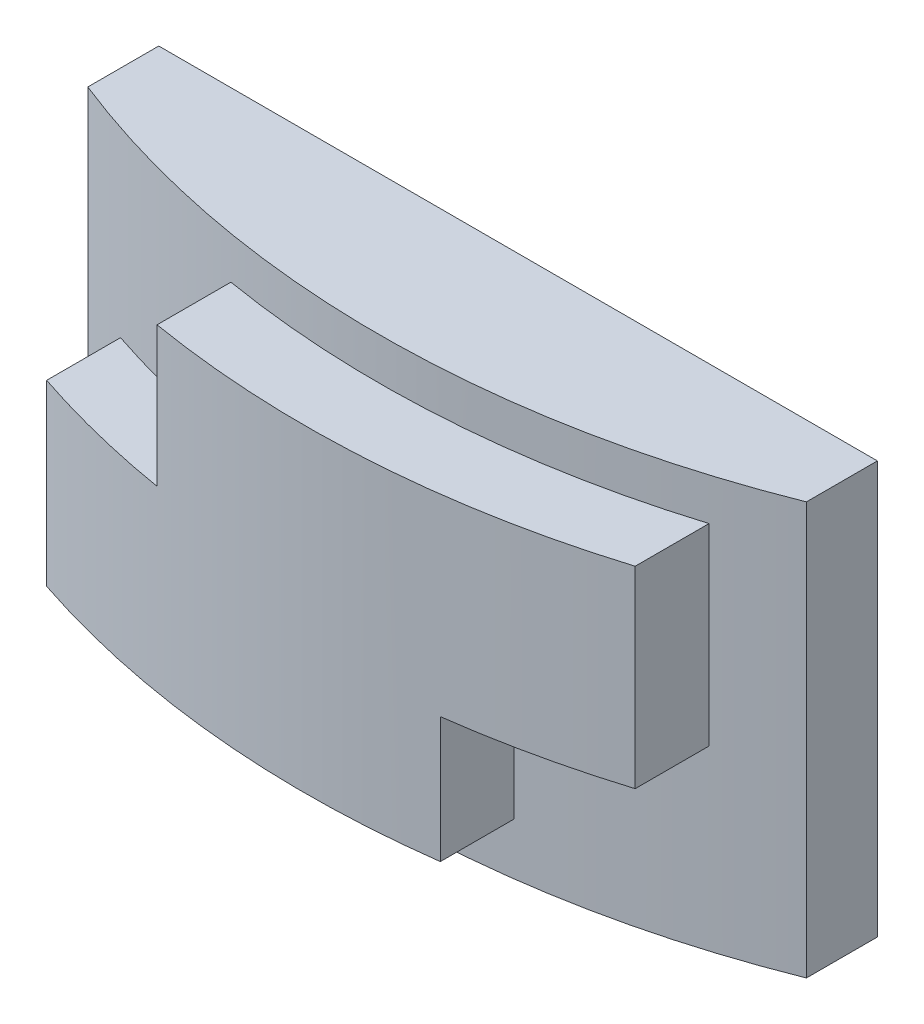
ISO-10303-21;
HEADER;
FILE_DESCRIPTION(('STEP AP214'),'2;1');
FILE_NAME('part.step','',(''),(''),'','','');
FILE_SCHEMA(('AUTOMOTIVE_DESIGN { 1 0 10303 214 1 1 1 1 }'));
ENDSEC;
DATA;
#1=APPLICATION_CONTEXT('core data for automotive mechanical design processes');
#2=APPLICATION_PROTOCOL_DEFINITION('international standard','automotive_design',2000,#1);
#3=PRODUCT_CONTEXT('',#1,'mechanical');
#4=PRODUCT('Part','Part','',(#3));
#5=PRODUCT_RELATED_PRODUCT_CATEGORY('part','',(#4));
#6=PRODUCT_DEFINITION_FORMATION('','',#4);
#7=PRODUCT_DEFINITION_CONTEXT('part definition',#1,'design');
#8=PRODUCT_DEFINITION('design','',#6,#7);
#9=PRODUCT_DEFINITION_SHAPE('','',#8);
#10=(LENGTH_UNIT() NAMED_UNIT(*) SI_UNIT(.MILLI.,.METRE.));
#11=(NAMED_UNIT(*) PLANE_ANGLE_UNIT() SI_UNIT($,.RADIAN.));
#12=(NAMED_UNIT(*) SI_UNIT($,.STERADIAN.) SOLID_ANGLE_UNIT());
#13=UNCERTAINTY_MEASURE_WITH_UNIT(LENGTH_MEASURE(1.E-05),#10,'distance_accuracy_value','');
#14=(GEOMETRIC_REPRESENTATION_CONTEXT(3) GLOBAL_UNCERTAINTY_ASSIGNED_CONTEXT((#13)) GLOBAL_UNIT_ASSIGNED_CONTEXT((#10,
#11,#12)) REPRESENTATION_CONTEXT('',''));
#15=CARTESIAN_POINT('',(0.,0.,0.));
#16=DIRECTION('',(0.,0.,1.));
#17=DIRECTION('',(1.,0.,0.));
#18=AXIS2_PLACEMENT_3D('',#15,#16,#17);
#19=CARTESIAN_POINT('',(1.12058823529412,69.4428014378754,-152.267457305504));
#20=DIRECTION('',(0.,-1.,0.));
#21=DIRECTION('',(0.,0.,-1.));
#22=AXIS2_PLACEMENT_3D('',#19,#20,#21);
#23=CYLINDRICAL_SURFACE('',#22,163.850701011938);
#24=DIRECTION('',(0.,-1.,0.));
#25=VECTOR('',#24,1.);
#26=CARTESIAN_POINT('',(-50.712715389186,69.4428014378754,3.16857731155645));
#27=LINE('',#26,#25);
#28=CARTESIAN_POINT('',(-50.712715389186,38.8031000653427,3.16857731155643));
#29=VERTEX_POINT('',#28);
#30=CARTESIAN_POINT('',(-50.712715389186,8.7600222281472,3.16857731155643));
#31=VERTEX_POINT('',#30);
#32=EDGE_CURVE('E136',#29,#31,#27,.T.);
#33=ORIENTED_EDGE('',*,*,#32,.F.);
#34=CARTESIAN_POINT('',(1.12058823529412,38.8031000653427,-152.267457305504));
#35=DIRECTION('',(0.,-1.,0.));
#36=DIRECTION('',(0.,0.,-1.));
#37=AXIS2_PLACEMENT_3D('',#34,#35,#36);
#38=CIRCLE('',#37,163.850701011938);
#39=CARTESIAN_POINT('',(-25.9572192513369,38.8031000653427,9.33032907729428));
#40=VERTEX_POINT('',#39);
#41=EDGE_CURVE('E47',#40,#29,#38,.T.);
#42=ORIENTED_EDGE('',*,*,#41,.F.);
#43=DIRECTION('',(0.,-1.,0.));
#44=VECTOR('',#43,1.);
#45=CARTESIAN_POINT('',(-25.9572192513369,69.4428014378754,9.33032907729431));
#46=LINE('',#45,#44);
#47=CARTESIAN_POINT('',(-25.9572192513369,62.356873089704,9.33032907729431));
#48=VERTEX_POINT('',#47);
#49=EDGE_CURVE('E52',#48,#40,#46,.T.);
#50=ORIENTED_EDGE('',*,*,#49,.F.);
#51=CARTESIAN_POINT('',(1.12058823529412,62.356873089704,-152.267457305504));
#52=DIRECTION('',(0.,-1.,0.));
#53=DIRECTION('',(1.,0.,0.));
#54=AXIS2_PLACEMENT_3D('',#51,#52,#53);
#55=CIRCLE('',#54,163.850701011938);
#56=CARTESIAN_POINT('',(49.5109922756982,62.3568730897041,4.27461697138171));
#57=VERTEX_POINT('',#56);
#58=EDGE_CURVE('E162',#57,#48,#55,.T.);
#59=ORIENTED_EDGE('',*,*,#58,.F.);
#60=DIRECTION('',(0.,-1.,0.));
#61=VECTOR('',#60,1.);
#62=CARTESIAN_POINT('',(49.5109922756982,69.4428014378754,4.27461697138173));
#63=LINE('',#62,#61);
#64=CARTESIAN_POINT('',(49.5109922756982,29.9103490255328,4.27461697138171));
#65=VERTEX_POINT('',#64);
#66=EDGE_CURVE('E161',#57,#65,#63,.T.);
#67=ORIENTED_EDGE('',*,*,#66,.T.);
#68=CARTESIAN_POINT('',(1.12058823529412,29.9103490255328,-152.267457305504));
#69=DIRECTION('',(0.,1.,0.));
#70=DIRECTION('',(0.,0.,1.));
#71=AXIS2_PLACEMENT_3D('',#68,#69,#70);
#72=CIRCLE('',#71,163.850701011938);
#73=CARTESIAN_POINT('',(22.592394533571,29.9103490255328,10.1702653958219));
#74=VERTEX_POINT('',#73);
#75=EDGE_CURVE('E153',#74,#65,#72,.T.);
#76=ORIENTED_EDGE('',*,*,#75,.F.);
#77=DIRECTION('',(0.,-1.,0.));
#78=VECTOR('',#77,1.);
#79=CARTESIAN_POINT('',(22.592394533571,69.4428014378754,10.1702653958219));
#80=LINE('',#79,#78);
#81=CARTESIAN_POINT('',(22.592394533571,8.76002222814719,10.1702653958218));
#82=VERTEX_POINT('',#81);
#83=EDGE_CURVE('E148',#74,#82,#80,.T.);
#84=ORIENTED_EDGE('',*,*,#83,.T.);
#85=CARTESIAN_POINT('',(1.12058823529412,8.76002222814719,-152.267457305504));
#86=DIRECTION('',(0.,1.,0.));
#87=DIRECTION('',(-1.,0.,0.));
#88=AXIS2_PLACEMENT_3D('',#85,#86,#87);
#89=CIRCLE('',#88,163.850701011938);
#90=EDGE_CURVE('E144',#31,#82,#89,.T.);
#91=ORIENTED_EDGE('',*,*,#90,.F.);
#92=EDGE_LOOP('',(#33,#42,#50,#59,#67,#76,#84,#91));
#93=FACE_BOUND('',#92,.T.);
#94=CARTESIAN_POINT('',(1.12058823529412,0.,-152.267457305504));
#95=DIRECTION('',(0.,1.,0.));
#96=DIRECTION('',(0.,0.,1.));
#97=AXIS2_PLACEMENT_3D('',#94,#95,#96);
#98=CIRCLE('',#97,163.850701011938);
#99=CARTESIAN_POINT('',(-59.3911764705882,0.,0.));
#100=VERTEX_POINT('',#99);
#101=CARTESIAN_POINT('',(61.6323529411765,0.,0.));
#102=VERTEX_POINT('',#101);
#103=EDGE_CURVE('E146',#100,#102,#98,.T.);
#104=ORIENTED_EDGE('',*,*,#103,.T.);
#105=DIRECTION('',(0.,-1.,0.));
#106=VECTOR('',#105,1.);
#107=CARTESIAN_POINT('',(61.6323529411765,69.4428014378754,0.));
#108=LINE('',#107,#106);
#109=CARTESIAN_POINT('',(61.6323529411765,69.4428014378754,0.));
#110=VERTEX_POINT('',#109);
#111=EDGE_CURVE('E11',#110,#102,#108,.T.);
#112=ORIENTED_EDGE('',*,*,#111,.F.);
#113=CARTESIAN_POINT('',(1.12058823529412,69.4428014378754,-152.267457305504));
#114=DIRECTION('',(0.,1.,0.));
#115=DIRECTION('',(0.,0.,1.));
#116=AXIS2_PLACEMENT_3D('',#113,#114,#115);
#117=CIRCLE('',#116,163.850701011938);
#118=CARTESIAN_POINT('',(-59.3911764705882,69.4428014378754,0.));
#119=VERTEX_POINT('',#118);
#120=EDGE_CURVE('E199',#119,#110,#117,.T.);
#121=ORIENTED_EDGE('',*,*,#120,.F.);
#122=DIRECTION('',(0.,-1.,0.));
#123=VECTOR('',#122,1.);
#124=CARTESIAN_POINT('',(-59.3911764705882,69.4428014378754,0.));
#125=LINE('',#124,#123);
#126=EDGE_CURVE('E208',#119,#100,#125,.T.);
#127=ORIENTED_EDGE('',*,*,#126,.T.);
#128=EDGE_LOOP('',(#104,#112,#121,#127));
#129=FACE_BOUND('',#128,.T.);
#130=ADVANCED_FACE('F33',(#93,#129),#23,.T.);
#131=CARTESIAN_POINT('',(61.6323529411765,69.4428014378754,-11.9529411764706));
#132=DIRECTION('',(-1.,0.,0.));
#133=DIRECTION('',(0.,0.,1.));
#134=AXIS2_PLACEMENT_3D('',#131,#132,#133);
#135=PLANE('',#134);
#136=DIRECTION('',(0.,0.,-1.));
#137=VECTOR('',#136,1.);
#138=CARTESIAN_POINT('',(61.6323529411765,0.,-11.9529411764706));
#139=LINE('',#138,#137);
#140=CARTESIAN_POINT('',(61.6323529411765,0.,-11.9529411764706));
#141=VERTEX_POINT('',#140);
#142=EDGE_CURVE('E193',#102,#141,#139,.T.);
#143=ORIENTED_EDGE('',*,*,#142,.T.);
#144=DIRECTION('',(0.,-1.,0.));
#145=VECTOR('',#144,1.);
#146=CARTESIAN_POINT('',(61.6323529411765,69.4428014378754,-11.9529411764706));
#147=LINE('',#146,#145);
#148=CARTESIAN_POINT('',(61.6323529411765,69.4428014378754,-11.9529411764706));
#149=VERTEX_POINT('',#148);
#150=EDGE_CURVE('E40',#149,#141,#147,.T.);
#151=ORIENTED_EDGE('',*,*,#150,.F.);
#152=DIRECTION('',(0.,0.,-1.));
#153=VECTOR('',#152,1.);
#154=CARTESIAN_POINT('',(61.6323529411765,69.4428014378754,-11.9529411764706));
#155=LINE('',#154,#153);
#156=EDGE_CURVE('E202',#110,#149,#155,.T.);
#157=ORIENTED_EDGE('',*,*,#156,.F.);
#158=ORIENTED_EDGE('',*,*,#111,.T.);
#159=EDGE_LOOP('',(#143,#151,#157,#158));
#160=FACE_BOUND('',#159,.T.);
#161=ADVANCED_FACE('F234',(#160),#135,.F.);
#162=CARTESIAN_POINT('',(-59.3911764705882,69.4428014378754,-11.9529411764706));
#163=DIRECTION('',(0.,0.,1.));
#164=DIRECTION('',(1.,0.,0.));
#165=AXIS2_PLACEMENT_3D('',#162,#163,#164);
#166=PLANE('',#165);
#167=DIRECTION('',(-1.,0.,0.));
#168=VECTOR('',#167,1.);
#169=CARTESIAN_POINT('',(-59.3911764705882,0.,-11.9529411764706));
#170=LINE('',#169,#168);
#171=CARTESIAN_POINT('',(-59.3911764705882,0.,-11.9529411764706));
#172=VERTEX_POINT('',#171);
#173=EDGE_CURVE('E195',#141,#172,#170,.T.);
#174=ORIENTED_EDGE('',*,*,#173,.T.);
#175=DIRECTION('',(0.,-1.,0.));
#176=VECTOR('',#175,1.);
#177=CARTESIAN_POINT('',(-59.3911764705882,69.4428014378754,-11.9529411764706));
#178=LINE('',#177,#176);
#179=CARTESIAN_POINT('',(-59.3911764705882,69.4428014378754,-11.9529411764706));
#180=VERTEX_POINT('',#179);
#181=EDGE_CURVE('E211',#180,#172,#178,.T.);
#182=ORIENTED_EDGE('',*,*,#181,.F.);
#183=DIRECTION('',(-1.,0.,0.));
#184=VECTOR('',#183,1.);
#185=CARTESIAN_POINT('',(-59.3911764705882,69.4428014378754,-11.9529411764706));
#186=LINE('',#185,#184);
#187=EDGE_CURVE('E204',#149,#180,#186,.T.);
#188=ORIENTED_EDGE('',*,*,#187,.F.);
#189=ORIENTED_EDGE('',*,*,#150,.T.);
#190=EDGE_LOOP('',(#174,#182,#188,#189));
#191=FACE_BOUND('',#190,.T.);
#192=ADVANCED_FACE('F218',(#191),#166,.F.);
#193=CARTESIAN_POINT('',(-59.3911764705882,69.4428014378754,0.));
#194=DIRECTION('',(1.,0.,0.));
#195=DIRECTION('',(0.,0.,-1.));
#196=AXIS2_PLACEMENT_3D('',#193,#194,#195);
#197=PLANE('',#196);
#198=DIRECTION('',(0.,0.,1.));
#199=VECTOR('',#198,1.);
#200=CARTESIAN_POINT('',(-59.3911764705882,0.,0.));
#201=LINE('',#200,#199);
#202=EDGE_CURVE('E197',#172,#100,#201,.T.);
#203=ORIENTED_EDGE('',*,*,#202,.T.);
#204=ORIENTED_EDGE('',*,*,#126,.F.);
#205=DIRECTION('',(0.,0.,1.));
#206=VECTOR('',#205,1.);
#207=CARTESIAN_POINT('',(-59.3911764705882,69.4428014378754,0.));
#208=LINE('',#207,#206);
#209=EDGE_CURVE('E206',#180,#119,#208,.T.);
#210=ORIENTED_EDGE('',*,*,#209,.F.);
#211=ORIENTED_EDGE('',*,*,#181,.T.);
#212=EDGE_LOOP('',(#203,#204,#210,#211));
#213=FACE_BOUND('',#212,.T.);
#214=ADVANCED_FACE('F227',(#213),#197,.F.);
#215=CARTESIAN_POINT('',(1.12058823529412,69.4428014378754,-152.267457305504));
#216=DIRECTION('',(0.,1.,0.));
#217=DIRECTION('',(0.,0.,1.));
#218=AXIS2_PLACEMENT_3D('',#215,#216,#217);
#219=PLANE('',#218);
#220=ORIENTED_EDGE('',*,*,#120,.T.);
#221=ORIENTED_EDGE('',*,*,#156,.T.);
#222=ORIENTED_EDGE('',*,*,#187,.T.);
#223=ORIENTED_EDGE('',*,*,#209,.T.);
#224=EDGE_LOOP('',(#220,#221,#222,#223));
#225=FACE_BOUND('',#224,.T.);
#226=ADVANCED_FACE('F233',(#225),#219,.T.);
#227=CARTESIAN_POINT('',(1.12058823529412,0.,-152.267457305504));
#228=DIRECTION('',(0.,1.,0.));
#229=DIRECTION('',(0.,0.,1.));
#230=AXIS2_PLACEMENT_3D('',#227,#228,#229);
#231=PLANE('',#230);
#232=ORIENTED_EDGE('',*,*,#103,.F.);
#233=ORIENTED_EDGE('',*,*,#202,.F.);
#234=ORIENTED_EDGE('',*,*,#173,.F.);
#235=ORIENTED_EDGE('',*,*,#142,.F.);
#236=EDGE_LOOP('',(#232,#233,#234,#235));
#237=FACE_BOUND('',#236,.T.);
#238=ADVANCED_FACE('F224',(#237),#231,.F.);
#239=CARTESIAN_POINT('',(1.12058823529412,69.4428014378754,-139.824655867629));
#240=DIRECTION('',(0.,-1.,0.));
#241=DIRECTION('',(0.,0.,-1.));
#242=AXIS2_PLACEMENT_3D('',#239,#240,#241);
#243=CYLINDRICAL_SURFACE('',#242,163.850701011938);
#244=DIRECTION('',(0.,-1.,0.));
#245=VECTOR('',#244,1.);
#246=CARTESIAN_POINT('',(-50.712715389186,69.4428014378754,15.6113787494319));
#247=LINE('',#246,#245);
#248=CARTESIAN_POINT('',(-50.7127153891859,38.8031000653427,15.6113787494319));
#249=VERTEX_POINT('',#248);
#250=CARTESIAN_POINT('',(-50.712715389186,8.76002222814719,15.6113787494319));
#251=VERTEX_POINT('',#250);
#252=EDGE_CURVE('E119',#249,#251,#247,.T.);
#253=ORIENTED_EDGE('',*,*,#252,.T.);
#254=CARTESIAN_POINT('',(1.12058823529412,8.76002222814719,-139.824655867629));
#255=DIRECTION('',(0.,1.,0.));
#256=DIRECTION('',(-1.,0.,0.));
#257=AXIS2_PLACEMENT_3D('',#254,#255,#256);
#258=CIRCLE('',#257,163.850701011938);
#259=CARTESIAN_POINT('',(22.592394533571,8.76002222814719,22.6130668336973));
#260=VERTEX_POINT('',#259);
#261=EDGE_CURVE('E123',#251,#260,#258,.T.);
#262=ORIENTED_EDGE('',*,*,#261,.T.);
#263=DIRECTION('',(0.,-1.,0.));
#264=VECTOR('',#263,1.);
#265=CARTESIAN_POINT('',(22.592394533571,69.4428014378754,22.6130668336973));
#266=LINE('',#265,#264);
#267=CARTESIAN_POINT('',(22.592394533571,29.9103490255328,22.6130668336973));
#268=VERTEX_POINT('',#267);
#269=EDGE_CURVE('E151',#268,#260,#266,.T.);
#270=ORIENTED_EDGE('',*,*,#269,.F.);
#271=CARTESIAN_POINT('',(1.12058823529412,29.9103490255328,-139.824655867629));
#272=DIRECTION('',(0.,1.,0.));
#273=DIRECTION('',(0.,0.,1.));
#274=AXIS2_PLACEMENT_3D('',#271,#272,#273);
#275=CIRCLE('',#274,163.850701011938);
#276=CARTESIAN_POINT('',(49.5109922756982,29.9103490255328,16.7174184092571));
#277=VERTEX_POINT('',#276);
#278=EDGE_CURVE('E154',#268,#277,#275,.T.);
#279=ORIENTED_EDGE('',*,*,#278,.T.);
#280=DIRECTION('',(0.,-1.,0.));
#281=VECTOR('',#280,1.);
#282=CARTESIAN_POINT('',(49.5109922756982,69.4428014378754,16.7174184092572));
#283=LINE('',#282,#281);
#284=CARTESIAN_POINT('',(49.5109922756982,62.3568730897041,16.7174184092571));
#285=VERTEX_POINT('',#284);
#286=EDGE_CURVE('E158',#285,#277,#283,.T.);
#287=ORIENTED_EDGE('',*,*,#286,.F.);
#288=CARTESIAN_POINT('',(1.12058823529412,62.356873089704,-139.824655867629));
#289=DIRECTION('',(0.,-1.,0.));
#290=DIRECTION('',(1.,0.,0.));
#291=AXIS2_PLACEMENT_3D('',#288,#289,#290);
#292=CIRCLE('',#291,163.850701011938);
#293=CARTESIAN_POINT('',(-25.9572192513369,62.356873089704,21.7731305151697));
#294=VERTEX_POINT('',#293);
#295=EDGE_CURVE('E163',#285,#294,#292,.T.);
#296=ORIENTED_EDGE('',*,*,#295,.T.);
#297=DIRECTION('',(0.,-1.,0.));
#298=VECTOR('',#297,1.);
#299=CARTESIAN_POINT('',(-25.9572192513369,69.4428014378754,21.7731305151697));
#300=LINE('',#299,#298);
#301=CARTESIAN_POINT('',(-25.9572192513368,38.8031000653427,21.7731305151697));
#302=VERTEX_POINT('',#301);
#303=EDGE_CURVE('E166',#294,#302,#300,.T.);
#304=ORIENTED_EDGE('',*,*,#303,.T.);
#305=CARTESIAN_POINT('',(1.12058823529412,38.8031000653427,-139.824655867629));
#306=DIRECTION('',(0.,-1.,0.));
#307=DIRECTION('',(0.,0.,-1.));
#308=AXIS2_PLACEMENT_3D('',#305,#306,#307);
#309=CIRCLE('',#308,163.850701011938);
#310=EDGE_CURVE('E126',#302,#249,#309,.T.);
#311=ORIENTED_EDGE('',*,*,#310,.T.);
#312=EDGE_LOOP('',(#253,#262,#270,#279,#287,#296,#304,#311));
#313=FACE_BOUND('',#312,.T.);
#314=ADVANCED_FACE('F121',(#313),#243,.T.);
#315=CARTESIAN_POINT('',(-50.712715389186,69.4428014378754,3.16857731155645));
#316=DIRECTION('',(-1.,0.,0.));
#317=DIRECTION('',(0.,0.,1.));
#318=AXIS2_PLACEMENT_3D('',#315,#316,#317);
#319=PLANE('',#318);
#320=ORIENTED_EDGE('',*,*,#252,.F.);
#321=DIRECTION('',(0.,0.,1.));
#322=VECTOR('',#321,1.);
#323=CARTESIAN_POINT('',(-50.7127153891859,38.8031000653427,3.16857731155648));
#324=LINE('',#323,#322);
#325=EDGE_CURVE('E130',#29,#249,#324,.T.);
#326=ORIENTED_EDGE('',*,*,#325,.F.);
#327=ORIENTED_EDGE('',*,*,#32,.T.);
#328=DIRECTION('',(0.,0.,1.));
#329=VECTOR('',#328,1.);
#330=CARTESIAN_POINT('',(-50.712715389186,8.7600222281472,3.16857731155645));
#331=LINE('',#330,#329);
#332=EDGE_CURVE('E134',#31,#251,#331,.T.);
#333=ORIENTED_EDGE('',*,*,#332,.T.);
#334=EDGE_LOOP('',(#320,#326,#327,#333));
#335=FACE_BOUND('',#334,.T.);
#336=ADVANCED_FACE('F135',(#335),#319,.T.);
#337=CARTESIAN_POINT('',(-50.7127153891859,38.8031000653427,3.16857731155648));
#338=DIRECTION('',(0.,1.,0.));
#339=DIRECTION('',(0.,0.,1.));
#340=AXIS2_PLACEMENT_3D('',#337,#338,#339);
#341=PLANE('',#340);
#342=ORIENTED_EDGE('',*,*,#310,.F.);
#343=DIRECTION('',(0.,0.,1.));
#344=VECTOR('',#343,1.);
#345=CARTESIAN_POINT('',(-25.9572192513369,38.8031000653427,9.33032907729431));
#346=LINE('',#345,#344);
#347=EDGE_CURVE('E169',#40,#302,#346,.T.);
#348=ORIENTED_EDGE('',*,*,#347,.F.);
#349=ORIENTED_EDGE('',*,*,#41,.T.);
#350=ORIENTED_EDGE('',*,*,#325,.T.);
#351=EDGE_LOOP('',(#342,#348,#349,#350));
#352=FACE_BOUND('',#351,.T.);
#353=ADVANCED_FACE('F269',(#352),#341,.T.);
#354=CARTESIAN_POINT('',(-25.9572192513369,69.4428014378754,9.33032907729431));
#355=DIRECTION('',(-1.,0.,0.));
#356=DIRECTION('',(0.,0.,1.));
#357=AXIS2_PLACEMENT_3D('',#354,#355,#356);
#358=PLANE('',#357);
#359=ORIENTED_EDGE('',*,*,#303,.F.);
#360=DIRECTION('',(0.,0.,1.));
#361=VECTOR('',#360,1.);
#362=CARTESIAN_POINT('',(-25.9572192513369,62.356873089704,9.33032907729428));
#363=LINE('',#362,#361);
#364=EDGE_CURVE('E168',#48,#294,#363,.T.);
#365=ORIENTED_EDGE('',*,*,#364,.F.);
#366=ORIENTED_EDGE('',*,*,#49,.T.);
#367=ORIENTED_EDGE('',*,*,#347,.T.);
#368=EDGE_LOOP('',(#359,#365,#366,#367));
#369=FACE_BOUND('',#368,.T.);
#370=ADVANCED_FACE('F265',(#369),#358,.T.);
#371=CARTESIAN_POINT('',(-25.9572192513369,62.356873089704,9.33032907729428));
#372=DIRECTION('',(0.,1.,0.));
#373=DIRECTION('',(-1.,0.,0.));
#374=AXIS2_PLACEMENT_3D('',#371,#372,#373);
#375=PLANE('',#374);
#376=ORIENTED_EDGE('',*,*,#295,.F.);
#377=DIRECTION('',(0.,0.,1.));
#378=VECTOR('',#377,1.);
#379=CARTESIAN_POINT('',(49.5109922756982,62.3568730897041,4.27461697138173));
#380=LINE('',#379,#378);
#381=EDGE_CURVE('E165',#57,#285,#380,.T.);
#382=ORIENTED_EDGE('',*,*,#381,.F.);
#383=ORIENTED_EDGE('',*,*,#58,.T.);
#384=ORIENTED_EDGE('',*,*,#364,.T.);
#385=EDGE_LOOP('',(#376,#382,#383,#384));
#386=FACE_BOUND('',#385,.T.);
#387=ADVANCED_FACE('F258',(#386),#375,.T.);
#388=CARTESIAN_POINT('',(49.5109922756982,29.9103490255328,4.27461697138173));
#389=DIRECTION('',(0.,-1.,0.));
#390=DIRECTION('',(0.,0.,-1.));
#391=AXIS2_PLACEMENT_3D('',#388,#389,#390);
#392=PLANE('',#391);
#393=ORIENTED_EDGE('',*,*,#278,.F.);
#394=DIRECTION('',(0.,0.,1.));
#395=VECTOR('',#394,1.);
#396=CARTESIAN_POINT('',(22.592394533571,29.9103490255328,10.1702653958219));
#397=LINE('',#396,#395);
#398=EDGE_CURVE('E156',#74,#268,#397,.T.);
#399=ORIENTED_EDGE('',*,*,#398,.F.);
#400=ORIENTED_EDGE('',*,*,#75,.T.);
#401=DIRECTION('',(0.,0.,1.));
#402=VECTOR('',#401,1.);
#403=CARTESIAN_POINT('',(49.5109922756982,29.9103490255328,4.27461697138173));
#404=LINE('',#403,#402);
#405=EDGE_CURVE('E157',#65,#277,#404,.T.);
#406=ORIENTED_EDGE('',*,*,#405,.T.);
#407=EDGE_LOOP('',(#393,#399,#400,#406));
#408=FACE_BOUND('',#407,.T.);
#409=ADVANCED_FACE('F252',(#408),#392,.T.);
#410=CARTESIAN_POINT('',(22.592394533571,8.76002222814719,10.1702653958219));
#411=DIRECTION('',(0.,-1.,0.));
#412=DIRECTION('',(1.,0.,0.));
#413=AXIS2_PLACEMENT_3D('',#410,#411,#412);
#414=PLANE('',#413);
#415=ORIENTED_EDGE('',*,*,#261,.F.);
#416=ORIENTED_EDGE('',*,*,#332,.F.);
#417=ORIENTED_EDGE('',*,*,#90,.T.);
#418=DIRECTION('',(0.,0.,1.));
#419=VECTOR('',#418,1.);
#420=CARTESIAN_POINT('',(22.592394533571,8.76002222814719,10.1702653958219));
#421=LINE('',#420,#419);
#422=EDGE_CURVE('E142',#82,#260,#421,.T.);
#423=ORIENTED_EDGE('',*,*,#422,.T.);
#424=EDGE_LOOP('',(#415,#416,#417,#423));
#425=FACE_BOUND('',#424,.T.);
#426=ADVANCED_FACE('F140',(#425),#414,.T.);
#427=CARTESIAN_POINT('',(49.5109922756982,69.4428014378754,4.27461697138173));
#428=DIRECTION('',(-1.,0.,0.));
#429=DIRECTION('',(0.,0.,1.));
#430=AXIS2_PLACEMENT_3D('',#427,#428,#429);
#431=PLANE('',#430);
#432=ORIENTED_EDGE('',*,*,#286,.T.);
#433=ORIENTED_EDGE('',*,*,#405,.F.);
#434=ORIENTED_EDGE('',*,*,#66,.F.);
#435=ORIENTED_EDGE('',*,*,#381,.T.);
#436=EDGE_LOOP('',(#432,#433,#434,#435));
#437=FACE_BOUND('',#436,.T.);
#438=ADVANCED_FACE('F251',(#437),#431,.F.);
#439=CARTESIAN_POINT('',(22.592394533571,69.4428014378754,10.1702653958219));
#440=DIRECTION('',(-1.,0.,0.));
#441=DIRECTION('',(0.,0.,1.));
#442=AXIS2_PLACEMENT_3D('',#439,#440,#441);
#443=PLANE('',#442);
#444=ORIENTED_EDGE('',*,*,#269,.T.);
#445=ORIENTED_EDGE('',*,*,#422,.F.);
#446=ORIENTED_EDGE('',*,*,#83,.F.);
#447=ORIENTED_EDGE('',*,*,#398,.T.);
#448=EDGE_LOOP('',(#444,#445,#446,#447));
#449=FACE_BOUND('',#448,.T.);
#450=ADVANCED_FACE('F248',(#449),#443,.F.);
#451=CLOSED_SHELL('',(#130,#161,#192,#214,#226,#238,#314,#336,#353,#370,#387,#409,#426,#438,#450));
#452=MANIFOLD_SOLID_BREP('B2',#451);
#453=ADVANCED_BREP_SHAPE_REPRESENTATION('',(#18,#452),#14);
#454=SHAPE_DEFINITION_REPRESENTATION(#9,#453);
ENDSEC;
END-ISO-10303-21;
